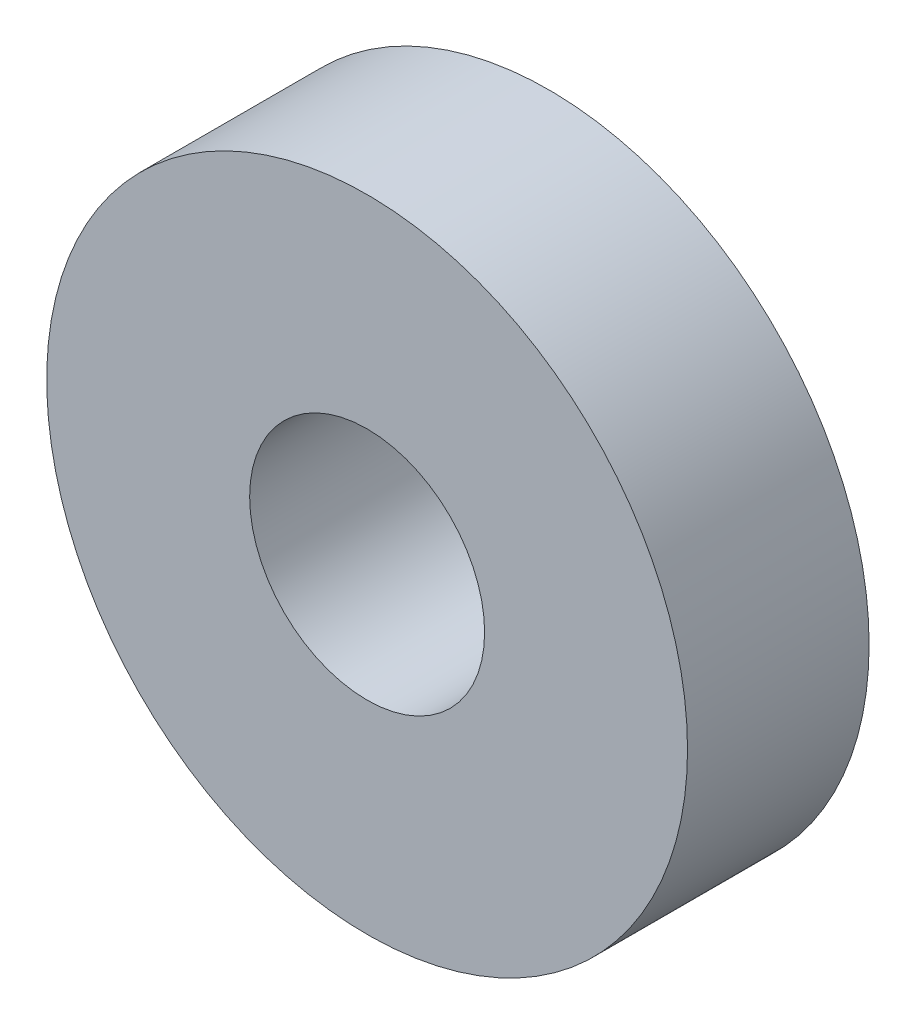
from build123d import *

# Parameters (mm, degrees)
ESQUISSE1_R      = 3
ESQUISSE1_R_2    = 1.1
EXTRUSION1_DEPTH = 1.7


with BuildPart() as part:
    # Esquisse1 → Extrusion1 (new body)
    with BuildSketch(Plane.XY):
        Circle(ESQUISSE1_R)
        Circle(ESQUISSE1_R_2, mode=Mode.SUBTRACT)
    extrude(amount=EXTRUSION1_DEPTH)


solid = part.part
